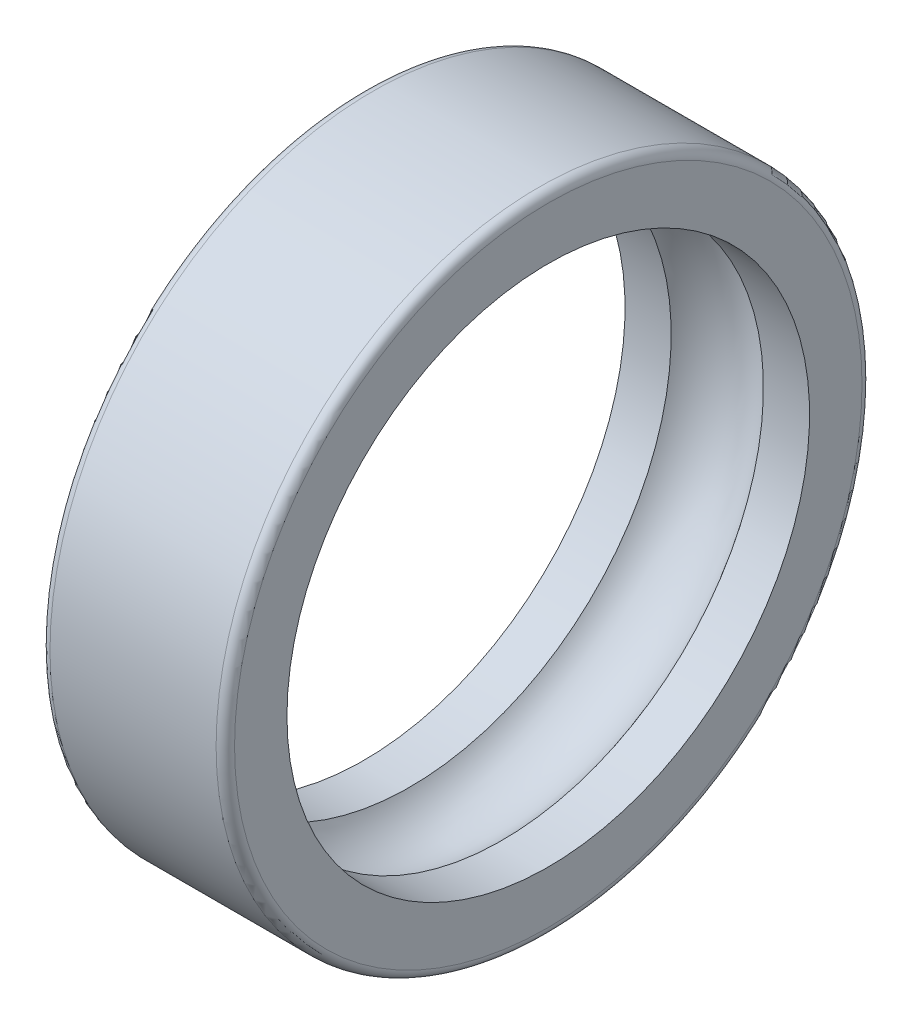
from build123d import *


with BuildPart() as part:
    # Esquisse1 → R_volution1 (revolve)
    with BuildSketch(Plane.XY, mode=Mode.PRIVATE) as r_volution1_sk:
        with BuildLine():
            Line((0, 13.6), (0, 11.328))
            Line((0, 11.328), (2.000896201, 11.328))
            ThreePointArc((2.000896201, 11.328), (4, 12.4), (5.999103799, 11.328))
            Line((5.999103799, 11.328), (8, 11.328))
            Line((8, 11.328), (8, 13.6))
            ThreePointArc((8, 13.6), (7.882842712, 13.882842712), (7.6, 14))
            Line((7.6, 14), (0.4, 14))
            ThreePointArc((0.4, 14), (0.117157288, 13.882842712), (0, 13.6))
        make_face()
    revolve(r_volution1_sk.sketch.rotate(Axis((8, 0, 0), (-1, 0, 0)), 270), axis=Axis((8, 0, 0), (-1, 0, 0)))


solid = part.part
